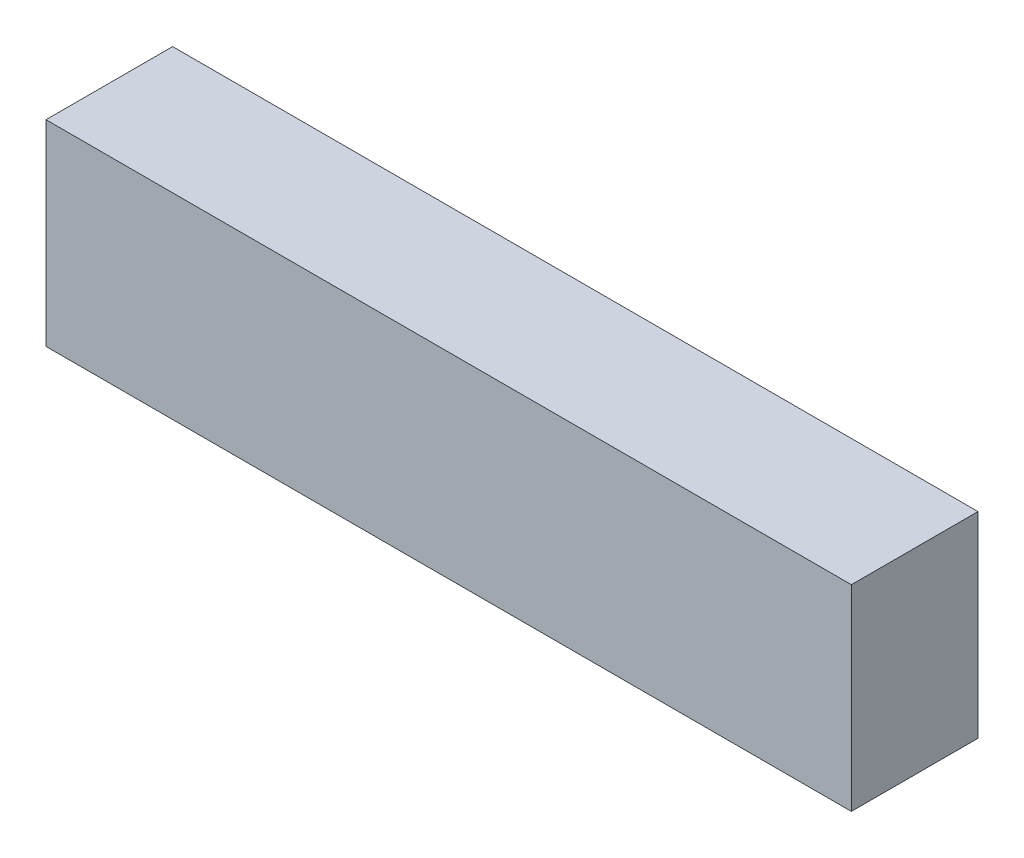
from build123d import *

# Parameters (mm, degrees)
SKETCH1_W           = 63.595505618
SKETCH1_H           = 15.505617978
BOSS_EXTRUDE1_DEPTH = 10


with BuildPart() as part:
    # Sketch1 → Boss-Extrude1 (new body)
    with BuildSketch(Plane.XY):
        with Locations((61.797752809, 57.752808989)):
            Rectangle(SKETCH1_W, SKETCH1_H)
    extrude(amount=BOSS_EXTRUDE1_DEPTH)


solid = part.part
